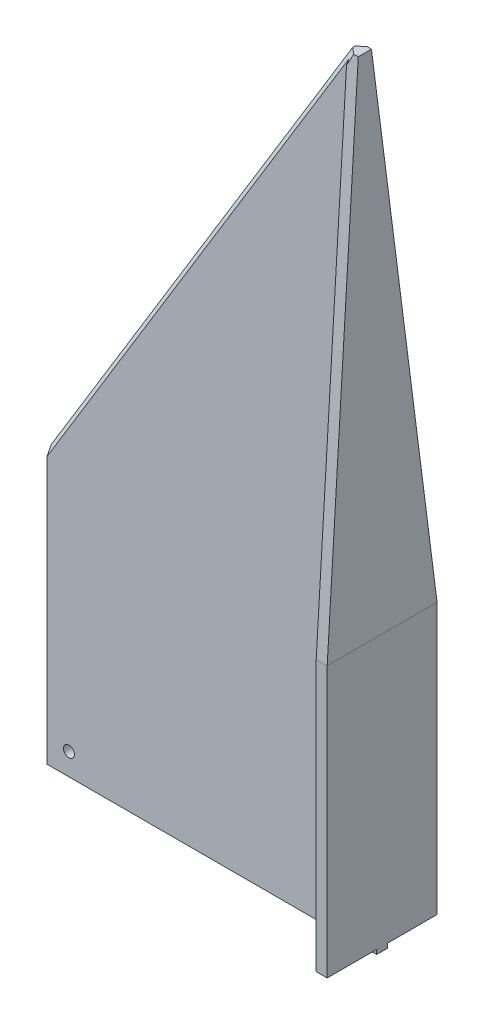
ISO-10303-21;
HEADER;
FILE_DESCRIPTION(('STEP AP214'),'2;1');
FILE_NAME('part.step','',(''),(''),'','','');
FILE_SCHEMA(('AUTOMOTIVE_DESIGN { 1 0 10303 214 1 1 1 1 }'));
ENDSEC;
DATA;
#1=APPLICATION_CONTEXT('core data for automotive mechanical design processes');
#2=APPLICATION_PROTOCOL_DEFINITION('international standard','automotive_design',2000,#1);
#3=PRODUCT_CONTEXT('',#1,'mechanical');
#4=PRODUCT('Part','Part','',(#3));
#5=PRODUCT_RELATED_PRODUCT_CATEGORY('part','',(#4));
#6=PRODUCT_DEFINITION_FORMATION('','',#4);
#7=PRODUCT_DEFINITION_CONTEXT('part definition',#1,'design');
#8=PRODUCT_DEFINITION('design','',#6,#7);
#9=PRODUCT_DEFINITION_SHAPE('','',#8);
#10=(LENGTH_UNIT() NAMED_UNIT(*) SI_UNIT(.MILLI.,.METRE.));
#11=(NAMED_UNIT(*) PLANE_ANGLE_UNIT() SI_UNIT($,.RADIAN.));
#12=(NAMED_UNIT(*) SI_UNIT($,.STERADIAN.) SOLID_ANGLE_UNIT());
#13=UNCERTAINTY_MEASURE_WITH_UNIT(LENGTH_MEASURE(1.E-05),#10,'distance_accuracy_value','');
#14=(GEOMETRIC_REPRESENTATION_CONTEXT(3) GLOBAL_UNCERTAINTY_ASSIGNED_CONTEXT((#13)) GLOBAL_UNIT_ASSIGNED_CONTEXT((#10,
#11,#12)) REPRESENTATION_CONTEXT('',''));
#15=CARTESIAN_POINT('',(0.,0.,0.));
#16=DIRECTION('',(0.,0.,1.));
#17=DIRECTION('',(1.,0.,0.));
#18=AXIS2_PLACEMENT_3D('',#15,#16,#17);
#19=CARTESIAN_POINT('',(0.,-125.,2.5));
#20=DIRECTION('',(0.,0.,1.));
#21=DIRECTION('',(1.,0.,0.));
#22=AXIS2_PLACEMENT_3D('',#19,#20,#21);
#23=PLANE('',#22);
#24=CARTESIAN_POINT('',(-140.,-115.,2.5));
#25=DIRECTION('',(0.,0.,1.));
#26=DIRECTION('',(1.,0.,0.));
#27=AXIS2_PLACEMENT_3D('',#24,#25,#26);
#28=CIRCLE('',#27,2.5);
#29=CARTESIAN_POINT('',(-137.5,-115.,2.5));
#30=VERTEX_POINT('',#29);
#31=EDGE_CURVE('E202',#30,#30,#28,.T.);
#32=ORIENTED_EDGE('',*,*,#31,.F.);
#33=EDGE_LOOP('',(#32));
#34=FACE_BOUND('',#33,.T.);
#35=DIRECTION('',(-0.0348994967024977,0.999390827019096,0.));
#36=VECTOR('',#35,1.);
#37=CARTESIAN_POINT('',(-0.634130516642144,-125.022144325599,2.5));
#38=LINE('',#37,#36);
#39=CARTESIAN_POINT('',(-5.,0.,2.5));
#40=VERTEX_POINT('',#39);
#41=CARTESIAN_POINT('',(-12.7302533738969,221.365493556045,2.49999999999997));
#42=VERTEX_POINT('',#41);
#43=EDGE_CURVE('E230',#40,#42,#38,.T.);
#44=ORIENTED_EDGE('',*,*,#43,.T.);
#45=DIRECTION('',(-0.520462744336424,-0.853884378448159,0.));
#46=VECTOR('',#45,1.);
#47=CARTESIAN_POINT('',(-148.292231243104,-1.04092548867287,2.5));
#48=LINE('',#47,#46);
#49=CARTESIAN_POINT('',(-150.,-3.84273422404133,2.5));
#50=VERTEX_POINT('',#49);
#51=EDGE_CURVE('E221',#42,#50,#48,.T.);
#52=ORIENTED_EDGE('',*,*,#51,.T.);
#53=DIRECTION('',(0.,-1.,0.));
#54=VECTOR('',#53,1.);
#55=CARTESIAN_POINT('',(-150.,0.,2.5));
#56=LINE('',#55,#54);
#57=CARTESIAN_POINT('',(-150.,-125.,2.5));
#58=VERTEX_POINT('',#57);
#59=EDGE_CURVE('E227',#50,#58,#56,.T.);
#60=ORIENTED_EDGE('',*,*,#59,.T.);
#61=DIRECTION('',(1.,0.,0.));
#62=VECTOR('',#61,1.);
#63=CARTESIAN_POINT('',(-150.,-125.,2.5));
#64=LINE('',#63,#62);
#65=CARTESIAN_POINT('',(0.,-125.,2.5));
#66=VERTEX_POINT('',#65);
#67=EDGE_CURVE('E244',#58,#66,#64,.T.);
#68=ORIENTED_EDGE('',*,*,#67,.T.);
#69=DIRECTION('',(0.,1.,0.));
#70=VECTOR('',#69,1.);
#71=CARTESIAN_POINT('',(0.,-125.,2.5));
#72=LINE('',#71,#70);
#73=CARTESIAN_POINT('',(0.,-123.,2.5));
#74=VERTEX_POINT('',#73);
#75=EDGE_CURVE('E239',#66,#74,#72,.T.);
#76=ORIENTED_EDGE('',*,*,#75,.T.);
#77=DIRECTION('',(-1.,0.,0.));
#78=VECTOR('',#77,1.);
#79=CARTESIAN_POINT('',(0.,-123.,2.5));
#80=LINE('',#79,#78);
#81=CARTESIAN_POINT('',(-5.,-123.,2.5));
#82=VERTEX_POINT('',#81);
#83=EDGE_CURVE('E284',#74,#82,#80,.T.);
#84=ORIENTED_EDGE('',*,*,#83,.T.);
#85=DIRECTION('',(0.,1.,0.));
#86=VECTOR('',#85,1.);
#87=CARTESIAN_POINT('',(-5.,-125.,2.5));
#88=LINE('',#87,#86);
#89=EDGE_CURVE('E290',#82,#40,#88,.T.);
#90=ORIENTED_EDGE('',*,*,#89,.T.);
#91=EDGE_LOOP('',(#44,#52,#60,#68,#76,#84,#90));
#92=FACE_BOUND('',#91,.T.);
#93=ADVANCED_FACE('F34',(#34,#92),#23,.T.);
#94=CARTESIAN_POINT('',(0.,-125.,-2.5));
#95=DIRECTION('',(0.,0.,1.));
#96=DIRECTION('',(1.,0.,0.));
#97=AXIS2_PLACEMENT_3D('',#94,#95,#96);
#98=PLANE('',#97);
#99=CARTESIAN_POINT('',(-140.,-115.,-2.5));
#100=DIRECTION('',(0.,0.,1.));
#101=DIRECTION('',(1.,0.,0.));
#102=AXIS2_PLACEMENT_3D('',#99,#100,#101);
#103=CIRCLE('',#102,2.5);
#104=CARTESIAN_POINT('',(-137.5,-115.,-2.5));
#105=VERTEX_POINT('',#104);
#106=EDGE_CURVE('E199',#105,#105,#103,.T.);
#107=ORIENTED_EDGE('',*,*,#106,.T.);
#108=EDGE_LOOP('',(#107));
#109=FACE_BOUND('',#108,.T.);
#110=DIRECTION('',(0.,-1.,0.));
#111=VECTOR('',#110,1.);
#112=CARTESIAN_POINT('',(-150.,0.,-2.5));
#113=LINE('',#112,#111);
#114=CARTESIAN_POINT('',(-150.,-3.84273422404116,-2.5));
#115=VERTEX_POINT('',#114);
#116=CARTESIAN_POINT('',(-150.,-125.,-2.5));
#117=VERTEX_POINT('',#116);
#118=EDGE_CURVE('E254',#115,#117,#113,.T.);
#119=ORIENTED_EDGE('',*,*,#118,.F.);
#120=DIRECTION('',(0.520462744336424,0.853884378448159,0.));
#121=VECTOR('',#120,1.);
#122=CARTESIAN_POINT('',(-163.211886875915,-25.5184909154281,-2.5));
#123=LINE('',#122,#121);
#124=CARTESIAN_POINT('',(-12.7302533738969,221.365493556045,-2.49999999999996));
#125=VERTEX_POINT('',#124);
#126=EDGE_CURVE('E211',#115,#125,#123,.T.);
#127=ORIENTED_EDGE('',*,*,#126,.T.);
#128=DIRECTION('',(-0.0348994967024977,0.999390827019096,0.));
#129=VECTOR('',#128,1.);
#130=CARTESIAN_POINT('',(-0.634130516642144,-125.022144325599,-2.5));
#131=LINE('',#130,#129);
#132=CARTESIAN_POINT('',(-5.,0.,-2.5));
#133=VERTEX_POINT('',#132);
#134=EDGE_CURVE('E181',#133,#125,#131,.T.);
#135=ORIENTED_EDGE('',*,*,#134,.F.);
#136=DIRECTION('',(0.,1.,0.));
#137=VECTOR('',#136,1.);
#138=CARTESIAN_POINT('',(-5.,-125.,-2.5));
#139=LINE('',#138,#137);
#140=CARTESIAN_POINT('',(-5.,-123.,-2.5));
#141=VERTEX_POINT('',#140);
#142=EDGE_CURVE('E185',#141,#133,#139,.T.);
#143=ORIENTED_EDGE('',*,*,#142,.F.);
#144=DIRECTION('',(-1.,0.,0.));
#145=VECTOR('',#144,1.);
#146=CARTESIAN_POINT('',(0.,-123.,-2.5));
#147=LINE('',#146,#145);
#148=CARTESIAN_POINT('',(0.,-123.,-2.5));
#149=VERTEX_POINT('',#148);
#150=EDGE_CURVE('E263',#149,#141,#147,.T.);
#151=ORIENTED_EDGE('',*,*,#150,.F.);
#152=DIRECTION('',(0.,1.,0.));
#153=VECTOR('',#152,1.);
#154=CARTESIAN_POINT('',(0.,-125.,-2.5));
#155=LINE('',#154,#153);
#156=CARTESIAN_POINT('',(0.,-125.,-2.5));
#157=VERTEX_POINT('',#156);
#158=EDGE_CURVE('E251',#157,#149,#155,.T.);
#159=ORIENTED_EDGE('',*,*,#158,.F.);
#160=DIRECTION('',(1.,0.,0.));
#161=VECTOR('',#160,1.);
#162=CARTESIAN_POINT('',(-150.,-125.,-2.5));
#163=LINE('',#162,#161);
#164=EDGE_CURVE('E248',#117,#157,#163,.T.);
#165=ORIENTED_EDGE('',*,*,#164,.F.);
#166=EDGE_LOOP('',(#119,#127,#135,#143,#151,#159,#165));
#167=FACE_BOUND('',#166,.T.);
#168=ADVANCED_FACE('F315',(#109,#167),#98,.F.);
#169=CARTESIAN_POINT('',(-150.,-125.,2.5));
#170=DIRECTION('',(0.,1.,0.));
#171=DIRECTION('',(0.,0.,1.));
#172=AXIS2_PLACEMENT_3D('',#169,#170,#171);
#173=PLANE('',#172);
#174=ORIENTED_EDGE('',*,*,#164,.T.);
#175=DIRECTION('',(0.,0.,-1.));
#176=VECTOR('',#175,1.);
#177=CARTESIAN_POINT('',(0.,-125.,2.5));
#178=LINE('',#177,#176);
#179=EDGE_CURVE('E166',#66,#157,#178,.T.);
#180=ORIENTED_EDGE('',*,*,#179,.F.);
#181=ORIENTED_EDGE('',*,*,#67,.F.);
#182=DIRECTION('',(0.,0.,-1.));
#183=VECTOR('',#182,1.);
#184=CARTESIAN_POINT('',(-150.,-125.,2.5));
#185=LINE('',#184,#183);
#186=EDGE_CURVE('E237',#58,#117,#185,.T.);
#187=ORIENTED_EDGE('',*,*,#186,.T.);
#188=EDGE_LOOP('',(#174,#180,#181,#187));
#189=FACE_BOUND('',#188,.T.);
#190=ADVANCED_FACE('F294',(#189),#173,.F.);
#191=CARTESIAN_POINT('',(0.,-125.,2.5));
#192=DIRECTION('',(-1.,0.,0.));
#193=DIRECTION('',(0.,0.,1.));
#194=AXIS2_PLACEMENT_3D('',#191,#192,#193);
#195=PLANE('',#194);
#196=DIRECTION('',(0.,0.,-1.));
#197=VECTOR('',#196,1.);
#198=CARTESIAN_POINT('',(0.,0.,2.5));
#199=LINE('',#198,#197);
#200=CARTESIAN_POINT('',(0.,0.,25.));
#201=VERTEX_POINT('',#200);
#202=CARTESIAN_POINT('',(0.,0.,-25.));
#203=VERTEX_POINT('',#202);
#204=EDGE_CURVE('E149',#201,#203,#199,.T.);
#205=ORIENTED_EDGE('',*,*,#204,.F.);
#206=DIRECTION('',(0.,1.,0.));
#207=VECTOR('',#206,1.);
#208=CARTESIAN_POINT('',(0.,-123.,25.));
#209=LINE('',#208,#207);
#210=CARTESIAN_POINT('',(0.,-123.,25.));
#211=VERTEX_POINT('',#210);
#212=EDGE_CURVE('E162',#211,#201,#209,.T.);
#213=ORIENTED_EDGE('',*,*,#212,.F.);
#214=DIRECTION('',(0.,0.,-1.));
#215=VECTOR('',#214,1.);
#216=CARTESIAN_POINT('',(0.,-123.,25.));
#217=LINE('',#216,#215);
#218=EDGE_CURVE('E297',#211,#74,#217,.T.);
#219=ORIENTED_EDGE('',*,*,#218,.T.);
#220=ORIENTED_EDGE('',*,*,#75,.F.);
#221=ORIENTED_EDGE('',*,*,#179,.T.);
#222=ORIENTED_EDGE('',*,*,#158,.T.);
#223=CARTESIAN_POINT('',(0.,-123.,-25.));
#224=VERTEX_POINT('',#223);
#225=EDGE_CURVE('E299',#149,#224,#217,.T.);
#226=ORIENTED_EDGE('',*,*,#225,.T.);
#227=DIRECTION('',(0.,1.,0.));
#228=VECTOR('',#227,1.);
#229=CARTESIAN_POINT('',(0.,-123.,-25.));
#230=LINE('',#229,#228);
#231=EDGE_CURVE('E164',#224,#203,#230,.T.);
#232=ORIENTED_EDGE('',*,*,#231,.T.);
#233=EDGE_LOOP('',(#205,#213,#219,#220,#221,#222,#226,#232));
#234=FACE_BOUND('',#233,.T.);
#235=ADVANCED_FACE('F160',(#234),#195,.F.);
#236=CARTESIAN_POINT('',(0.,0.,2.5));
#237=DIRECTION('',(-0.999390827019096,-0.0348994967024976,0.));
#238=DIRECTION('',(0.0348994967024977,-0.999390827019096,0.));
#239=AXIS2_PLACEMENT_3D('',#236,#237,#238);
#240=PLANE('',#239);
#241=ORIENTED_EDGE('',*,*,#204,.T.);
#242=DIRECTION('',(0.0347340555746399,-0.99465321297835,-0.0972549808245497));
#243=VECTOR('',#242,1.);
#244=CARTESIAN_POINT('',(-7.85717313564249,225.,-3.));
#245=LINE('',#244,#243);
#246=CARTESIAN_POINT('',(-7.85717313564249,225.,-3.));
#247=VERTEX_POINT('',#246);
#248=EDGE_CURVE('E196',#203,#247,#245,.F.);
#249=ORIENTED_EDGE('',*,*,#248,.T.);
#250=DIRECTION('',(0.,0.,-1.));
#251=VECTOR('',#250,1.);
#252=CARTESIAN_POINT('',(-7.85717313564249,225.,2.5));
#253=LINE('',#252,#251);
#254=CARTESIAN_POINT('',(-7.85717313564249,225.,2.99999999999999));
#255=VERTEX_POINT('',#254);
#256=EDGE_CURVE('E152',#255,#247,#253,.T.);
#257=ORIENTED_EDGE('',*,*,#256,.F.);
#258=DIRECTION('',(0.0347340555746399,-0.99465321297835,0.0972549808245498));
#259=VECTOR('',#258,1.);
#260=CARTESIAN_POINT('',(0.,0.,25.));
#261=LINE('',#260,#259);
#262=EDGE_CURVE('E146',#255,#201,#261,.T.);
#263=ORIENTED_EDGE('',*,*,#262,.T.);
#264=EDGE_LOOP('',(#241,#249,#257,#263));
#265=FACE_BOUND('',#264,.T.);
#266=ADVANCED_FACE('F148',(#265),#240,.F.);
#267=CARTESIAN_POINT('',(-7.85717313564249,225.,2.5));
#268=DIRECTION('',(0.,-1.,0.));
#269=DIRECTION('',(1.,0.,0.));
#270=AXIS2_PLACEMENT_3D('',#267,#268,#269);
#271=PLANE('',#270);
#272=DIRECTION('',(-1.,0.,0.));
#273=VECTOR('',#272,1.);
#274=CARTESIAN_POINT('',(-7.85717313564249,225.,-3.));
#275=LINE('',#274,#273);
#276=CARTESIAN_POINT('',(-9.92937627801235,225.,-3.));
#277=VERTEX_POINT('',#276);
#278=EDGE_CURVE('E154',#247,#277,#275,.T.);
#279=ORIENTED_EDGE('',*,*,#278,.T.);
#280=DIRECTION('',(0.760479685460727,0.,-0.649361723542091));
#281=VECTOR('',#280,1.);
#282=CARTESIAN_POINT('',(-12.8571731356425,225.,-0.499999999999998));
#283=LINE('',#282,#281);
#284=CARTESIAN_POINT('',(-12.8571731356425,225.,-0.499999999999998));
#285=VERTEX_POINT('',#284);
#286=EDGE_CURVE('E219',#277,#285,#283,.F.);
#287=ORIENTED_EDGE('',*,*,#286,.T.);
#288=DIRECTION('',(0.,0.,-1.));
#289=VECTOR('',#288,1.);
#290=CARTESIAN_POINT('',(-12.8571731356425,225.,2.5));
#291=LINE('',#290,#289);
#292=CARTESIAN_POINT('',(-12.8571731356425,225.,0.499999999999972));
#293=VERTEX_POINT('',#292);
#294=EDGE_CURVE('E257',#293,#285,#291,.T.);
#295=ORIENTED_EDGE('',*,*,#294,.F.);
#296=DIRECTION('',(0.760479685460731,0.,0.649361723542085));
#297=VECTOR('',#296,1.);
#298=CARTESIAN_POINT('',(-98.8240645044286,224.999999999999,-72.9057856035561));
#299=LINE('',#298,#297);
#300=CARTESIAN_POINT('',(-9.92937627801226,225.,2.99999999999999));
#301=VERTEX_POINT('',#300);
#302=EDGE_CURVE('E217',#293,#301,#299,.T.);
#303=ORIENTED_EDGE('',*,*,#302,.T.);
#304=DIRECTION('',(1.,0.,0.));
#305=VECTOR('',#304,1.);
#306=CARTESIAN_POINT('',(-7.85717313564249,225.,2.99999999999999));
#307=LINE('',#306,#305);
#308=EDGE_CURVE('E155',#301,#255,#307,.T.);
#309=ORIENTED_EDGE('',*,*,#308,.T.);
#310=ORIENTED_EDGE('',*,*,#256,.T.);
#311=EDGE_LOOP('',(#279,#287,#295,#303,#309,#310));
#312=FACE_BOUND('',#311,.T.);
#313=ADVANCED_FACE('F332',(#312),#271,.F.);
#314=CARTESIAN_POINT('',(-12.8571731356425,225.,2.5));
#315=DIRECTION('',(0.853884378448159,-0.520462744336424,0.));
#316=DIRECTION('',(0.520462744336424,0.853884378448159,0.));
#317=AXIS2_PLACEMENT_3D('',#314,#315,#316);
#318=PLANE('',#317);
#319=ORIENTED_EDGE('',*,*,#294,.T.);
#320=DIRECTION('',(-0.520462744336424,-0.853884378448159,0.));
#321=VECTOR('',#320,1.);
#322=CARTESIAN_POINT('',(-12.8571731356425,225.,-0.49999999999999));
#323=LINE('',#322,#321);
#324=CARTESIAN_POINT('',(-150.,0.,-0.499999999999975));
#325=VERTEX_POINT('',#324);
#326=EDGE_CURVE('E204',#285,#325,#323,.T.);
#327=ORIENTED_EDGE('',*,*,#326,.T.);
#328=DIRECTION('',(0.,0.,-1.));
#329=VECTOR('',#328,1.);
#330=CARTESIAN_POINT('',(-150.,0.,2.5));
#331=LINE('',#330,#329);
#332=CARTESIAN_POINT('',(-150.,0.,0.499999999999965));
#333=VERTEX_POINT('',#332);
#334=EDGE_CURVE('E241',#333,#325,#331,.T.);
#335=ORIENTED_EDGE('',*,*,#334,.F.);
#336=DIRECTION('',(0.520462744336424,0.853884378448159,0.));
#337=VECTOR('',#336,1.);
#338=CARTESIAN_POINT('',(-12.8571731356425,225.,0.499999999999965));
#339=LINE('',#338,#337);
#340=EDGE_CURVE('E198',#333,#293,#339,.T.);
#341=ORIENTED_EDGE('',*,*,#340,.T.);
#342=EDGE_LOOP('',(#319,#327,#335,#341));
#343=FACE_BOUND('',#342,.T.);
#344=ADVANCED_FACE('F329',(#343),#318,.F.);
#345=CARTESIAN_POINT('',(-150.,0.,2.5));
#346=DIRECTION('',(1.,0.,0.));
#347=DIRECTION('',(0.,1.,0.));
#348=AXIS2_PLACEMENT_3D('',#345,#346,#347);
#349=PLANE('',#348);
#350=ORIENTED_EDGE('',*,*,#334,.T.);
#351=DIRECTION('',(0.,0.887048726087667,0.461675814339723));
#352=VECTOR('',#351,1.);
#353=CARTESIAN_POINT('',(-150.,177.042474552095,91.6440121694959));
#354=LINE('',#353,#352);
#355=EDGE_CURVE('E209',#325,#115,#354,.F.);
#356=ORIENTED_EDGE('',*,*,#355,.T.);
#357=ORIENTED_EDGE('',*,*,#118,.T.);
#358=ORIENTED_EDGE('',*,*,#186,.F.);
#359=ORIENTED_EDGE('',*,*,#59,.F.);
#360=DIRECTION('',(0.,0.88704872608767,-0.461675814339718));
#361=VECTOR('',#360,1.);
#362=CARTESIAN_POINT('',(-150.,-20.8984213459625,11.3768497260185));
#363=LINE('',#362,#361);
#364=EDGE_CURVE('E207',#50,#333,#363,.T.);
#365=ORIENTED_EDGE('',*,*,#364,.T.);
#366=EDGE_LOOP('',(#350,#356,#357,#358,#359,#365));
#367=FACE_BOUND('',#366,.T.);
#368=ADVANCED_FACE('F234',(#367),#349,.F.);
#369=CARTESIAN_POINT('',(0.,225.,-25.));
#370=DIRECTION('',(0.,0.,1.));
#371=DIRECTION('',(1.,0.,0.));
#372=AXIS2_PLACEMENT_3D('',#369,#370,#371);
#373=PLANE('',#372);
#374=DIRECTION('',(0.,-1.,0.));
#375=VECTOR('',#374,1.);
#376=CARTESIAN_POINT('',(-5.,-123.,-25.));
#377=LINE('',#376,#375);
#378=CARTESIAN_POINT('',(-5.,0.,-25.));
#379=VERTEX_POINT('',#378);
#380=CARTESIAN_POINT('',(-5.,-123.,-25.));
#381=VERTEX_POINT('',#380);
#382=EDGE_CURVE('E303',#379,#381,#377,.T.);
#383=ORIENTED_EDGE('',*,*,#382,.F.);
#384=DIRECTION('',(1.,0.,0.));
#385=VECTOR('',#384,1.);
#386=CARTESIAN_POINT('',(1.2490009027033E-12,0.,-25.));
#387=LINE('',#386,#385);
#388=EDGE_CURVE('E194',#379,#203,#387,.T.);
#389=ORIENTED_EDGE('',*,*,#388,.T.);
#390=ORIENTED_EDGE('',*,*,#231,.F.);
#391=DIRECTION('',(1.,0.,0.));
#392=VECTOR('',#391,1.);
#393=CARTESIAN_POINT('',(0.,-123.,-25.));
#394=LINE('',#393,#392);
#395=EDGE_CURVE('E177',#381,#224,#394,.T.);
#396=ORIENTED_EDGE('',*,*,#395,.F.);
#397=EDGE_LOOP('',(#383,#389,#390,#396));
#398=FACE_BOUND('',#397,.T.);
#399=ADVANCED_FACE('F328',(#398),#373,.F.);
#400=CARTESIAN_POINT('',(0.,-123.,25.));
#401=DIRECTION('',(0.,1.,0.));
#402=DIRECTION('',(0.,0.,1.));
#403=AXIS2_PLACEMENT_3D('',#400,#401,#402);
#404=PLANE('',#403);
#405=ORIENTED_EDGE('',*,*,#225,.F.);
#406=ORIENTED_EDGE('',*,*,#150,.T.);
#407=DIRECTION('',(0.,0.,-1.));
#408=VECTOR('',#407,1.);
#409=CARTESIAN_POINT('',(-5.,-123.,25.));
#410=LINE('',#409,#408);
#411=EDGE_CURVE('E274',#141,#381,#410,.T.);
#412=ORIENTED_EDGE('',*,*,#411,.T.);
#413=ORIENTED_EDGE('',*,*,#395,.T.);
#414=EDGE_LOOP('',(#405,#406,#412,#413));
#415=FACE_BOUND('',#414,.T.);
#416=ADVANCED_FACE('F364',(#415),#404,.F.);
#417=CARTESIAN_POINT('',(-5.,-123.,25.));
#418=DIRECTION('',(1.,0.,0.));
#419=DIRECTION('',(0.,1.,0.));
#420=AXIS2_PLACEMENT_3D('',#417,#418,#419);
#421=PLANE('',#420);
#422=ORIENTED_EDGE('',*,*,#411,.F.);
#423=ORIENTED_EDGE('',*,*,#142,.T.);
#424=DIRECTION('',(0.,0.,-1.));
#425=VECTOR('',#424,1.);
#426=CARTESIAN_POINT('',(-5.,0.,25.));
#427=LINE('',#426,#425);
#428=EDGE_CURVE('E272',#133,#379,#427,.T.);
#429=ORIENTED_EDGE('',*,*,#428,.T.);
#430=ORIENTED_EDGE('',*,*,#382,.T.);
#431=EDGE_LOOP('',(#422,#423,#429,#430));
#432=FACE_BOUND('',#431,.T.);
#433=ADVANCED_FACE('F270',(#432),#421,.F.);
#434=CARTESIAN_POINT('',(-12.8571731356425,225.,25.));
#435=DIRECTION('',(0.999390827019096,0.0348994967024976,0.));
#436=DIRECTION('',(-0.0348994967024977,0.999390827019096,0.));
#437=AXIS2_PLACEMENT_3D('',#434,#435,#436);
#438=PLANE('',#437);
#439=ORIENTED_EDGE('',*,*,#134,.T.);
#440=DIRECTION('',(-0.0305801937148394,0.875702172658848,0.48188230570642));
#441=VECTOR('',#440,1.);
#442=CARTESIAN_POINT('',(-12.8571731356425,225.,-0.499999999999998));
#443=LINE('',#442,#441);
#444=CARTESIAN_POINT('',(-12.664242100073,219.475177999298,-3.54020481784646));
#445=VERTEX_POINT('',#444);
#446=EDGE_CURVE('E213',#125,#445,#443,.F.);
#447=ORIENTED_EDGE('',*,*,#446,.T.);
#448=DIRECTION('',(-0.0347340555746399,0.99465321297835,0.0972549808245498));
#449=VECTOR('',#448,1.);
#450=CARTESIAN_POINT('',(-12.8511408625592,224.827258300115,-3.01689029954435));
#451=LINE('',#450,#449);
#452=EDGE_CURVE('E192',#445,#379,#451,.F.);
#453=ORIENTED_EDGE('',*,*,#452,.T.);
#454=ORIENTED_EDGE('',*,*,#428,.F.);
#455=EDGE_LOOP('',(#439,#447,#453,#454));
#456=FACE_BOUND('',#455,.T.);
#457=ADVANCED_FACE('F277',(#456),#438,.F.);
#458=DIRECTION('',(-0.0347340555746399,0.99465321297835,-0.0972549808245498));
#459=VECTOR('',#458,1.);
#460=CARTESIAN_POINT('',(-4.99396772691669,-0.172741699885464,25.0168902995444));
#461=LINE('',#460,#459);
#462=CARTESIAN_POINT('',(-5.,0.,25.));
#463=VERTEX_POINT('',#462);
#464=CARTESIAN_POINT('',(-12.6642421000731,219.475177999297,3.54020481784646));
#465=VERTEX_POINT('',#464);
#466=EDGE_CURVE('E180',#463,#465,#461,.T.);
#467=ORIENTED_EDGE('',*,*,#466,.T.);
#468=DIRECTION('',(-0.0305801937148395,0.875702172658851,-0.481882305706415));
#469=VECTOR('',#468,1.);
#470=CARTESIAN_POINT('',(-6.25963471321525,36.0712186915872,104.463926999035));
#471=LINE('',#470,#469);
#472=EDGE_CURVE('E11',#465,#42,#471,.T.);
#473=ORIENTED_EDGE('',*,*,#472,.T.);
#474=ORIENTED_EDGE('',*,*,#43,.F.);
#475=EDGE_CURVE('E280',#463,#40,#427,.T.);
#476=ORIENTED_EDGE('',*,*,#475,.F.);
#477=EDGE_LOOP('',(#467,#473,#474,#476));
#478=FACE_BOUND('',#477,.T.);
#479=ADVANCED_FACE('F323',(#478),#438,.F.);
#480=ORIENTED_EDGE('',*,*,#89,.F.);
#481=CARTESIAN_POINT('',(-5.,-123.,25.));
#482=VERTEX_POINT('',#481);
#483=EDGE_CURVE('E281',#482,#82,#410,.T.);
#484=ORIENTED_EDGE('',*,*,#483,.F.);
#485=DIRECTION('',(0.,-1.,0.));
#486=VECTOR('',#485,1.);
#487=CARTESIAN_POINT('',(-5.,-123.,25.));
#488=LINE('',#487,#486);
#489=EDGE_CURVE('E176',#463,#482,#488,.T.);
#490=ORIENTED_EDGE('',*,*,#489,.F.);
#491=ORIENTED_EDGE('',*,*,#475,.T.);
#492=EDGE_LOOP('',(#480,#484,#490,#491));
#493=FACE_BOUND('',#492,.T.);
#494=ADVANCED_FACE('F377',(#493),#421,.F.);
#495=ORIENTED_EDGE('',*,*,#83,.F.);
#496=ORIENTED_EDGE('',*,*,#218,.F.);
#497=DIRECTION('',(1.,0.,0.));
#498=VECTOR('',#497,1.);
#499=CARTESIAN_POINT('',(0.,-123.,25.));
#500=LINE('',#499,#498);
#501=EDGE_CURVE('E174',#482,#211,#500,.T.);
#502=ORIENTED_EDGE('',*,*,#501,.F.);
#503=ORIENTED_EDGE('',*,*,#483,.T.);
#504=EDGE_LOOP('',(#495,#496,#502,#503));
#505=FACE_BOUND('',#504,.T.);
#506=ADVANCED_FACE('F372',(#505),#404,.F.);
#507=CARTESIAN_POINT('',(0.,225.,25.));
#508=DIRECTION('',(0.,0.,1.));
#509=DIRECTION('',(1.,0.,0.));
#510=AXIS2_PLACEMENT_3D('',#507,#508,#509);
#511=PLANE('',#510);
#512=ORIENTED_EDGE('',*,*,#212,.T.);
#513=DIRECTION('',(-1.,0.,0.));
#514=VECTOR('',#513,1.);
#515=CARTESIAN_POINT('',(-12.8571731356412,0.,25.));
#516=LINE('',#515,#514);
#517=EDGE_CURVE('E171',#201,#463,#516,.T.);
#518=ORIENTED_EDGE('',*,*,#517,.T.);
#519=ORIENTED_EDGE('',*,*,#489,.T.);
#520=ORIENTED_EDGE('',*,*,#501,.T.);
#521=EDGE_LOOP('',(#512,#518,#519,#520));
#522=FACE_BOUND('',#521,.T.);
#523=ADVANCED_FACE('F170',(#522),#511,.T.);
#524=CARTESIAN_POINT('',(1.2490009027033E-12,0.,25.));
#525=DIRECTION('',(0.,0.0973137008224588,0.99525375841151));
#526=DIRECTION('',(0.,-0.99525375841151,0.0973137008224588));
#527=AXIS2_PLACEMENT_3D('',#524,#525,#526);
#528=PLANE('',#527);
#529=ORIENTED_EDGE('',*,*,#308,.F.);
#530=DIRECTION('',(-0.441941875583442,-0.892786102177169,0.0872946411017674));
#531=VECTOR('',#530,1.);
#532=CARTESIAN_POINT('',(-97.6146872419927,47.8630701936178,20.3200553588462));
#533=LINE('',#532,#531);
#534=EDGE_CURVE('E42',#301,#465,#533,.T.);
#535=ORIENTED_EDGE('',*,*,#534,.T.);
#536=ORIENTED_EDGE('',*,*,#466,.F.);
#537=ORIENTED_EDGE('',*,*,#517,.F.);
#538=ORIENTED_EDGE('',*,*,#262,.F.);
#539=EDGE_LOOP('',(#529,#535,#536,#537,#538));
#540=FACE_BOUND('',#539,.T.);
#541=ADVANCED_FACE('F179',(#540),#528,.T.);
#542=CARTESIAN_POINT('',(-7.85717313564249,225.,-3.));
#543=DIRECTION('',(0.,-0.0973137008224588,0.99525375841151));
#544=DIRECTION('',(0.,-0.99525375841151,-0.0973137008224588));
#545=AXIS2_PLACEMENT_3D('',#542,#543,#544);
#546=PLANE('',#545);
#547=ORIENTED_EDGE('',*,*,#452,.F.);
#548=DIRECTION('',(0.441941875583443,0.892786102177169,0.0872946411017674));
#549=VECTOR('',#548,1.);
#550=CARTESIAN_POINT('',(-9.52464885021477,225.81760756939,-2.92005614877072));
#551=LINE('',#550,#549);
#552=EDGE_CURVE('E215',#445,#277,#551,.T.);
#553=ORIENTED_EDGE('',*,*,#552,.T.);
#554=ORIENTED_EDGE('',*,*,#278,.F.);
#555=ORIENTED_EDGE('',*,*,#248,.F.);
#556=ORIENTED_EDGE('',*,*,#388,.F.);
#557=EDGE_LOOP('',(#547,#553,#554,#555,#556));
#558=FACE_BOUND('',#557,.T.);
#559=ADVANCED_FACE('F345',(#558),#546,.F.);
#560=CARTESIAN_POINT('',(-140.,-115.,-25.));
#561=DIRECTION('',(0.,0.,1.));
#562=DIRECTION('',(1.,0.,0.));
#563=AXIS2_PLACEMENT_3D('',#560,#561,#562);
#564=CYLINDRICAL_SURFACE('',#563,2.5);
#565=ORIENTED_EDGE('',*,*,#31,.T.);
#566=EDGE_LOOP('',(#565));
#567=FACE_BOUND('',#566,.T.);
#568=ORIENTED_EDGE('',*,*,#106,.F.);
#569=EDGE_LOOP('',(#568));
#570=FACE_BOUND('',#569,.T.);
#571=ADVANCED_FACE('F311',(#567,#570),#564,.F.);
#572=CARTESIAN_POINT('',(-12.8571731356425,225.,-0.499999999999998));
#573=DIRECTION('',(0.603787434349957,-0.368022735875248,0.707106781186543));
#574=DIRECTION('',(0.760479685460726,0.,-0.649361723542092));
#575=AXIS2_PLACEMENT_3D('',#572,#573,#574);
#576=PLANE('',#575);
#577=ORIENTED_EDGE('',*,*,#446,.F.);
#578=ORIENTED_EDGE('',*,*,#126,.F.);
#579=ORIENTED_EDGE('',*,*,#355,.F.);
#580=ORIENTED_EDGE('',*,*,#326,.F.);
#581=ORIENTED_EDGE('',*,*,#286,.F.);
#582=ORIENTED_EDGE('',*,*,#552,.F.);
#583=EDGE_LOOP('',(#577,#578,#579,#580,#581,#582));
#584=FACE_BOUND('',#583,.T.);
#585=ADVANCED_FACE('F348',(#584),#576,.F.);
#586=CARTESIAN_POINT('',(-163.211886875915,-25.5184909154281,2.5));
#587=DIRECTION('',(-0.603787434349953,0.368022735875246,0.707106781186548));
#588=DIRECTION('',(0.76047968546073,0.,0.649361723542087));
#589=AXIS2_PLACEMENT_3D('',#586,#587,#588);
#590=PLANE('',#589);
#591=ORIENTED_EDGE('',*,*,#302,.F.);
#592=ORIENTED_EDGE('',*,*,#340,.F.);
#593=ORIENTED_EDGE('',*,*,#364,.F.);
#594=ORIENTED_EDGE('',*,*,#51,.F.);
#595=ORIENTED_EDGE('',*,*,#472,.F.);
#596=ORIENTED_EDGE('',*,*,#534,.F.);
#597=EDGE_LOOP('',(#591,#592,#593,#594,#595,#596));
#598=FACE_BOUND('',#597,.T.);
#599=ADVANCED_FACE('F36',(#598),#590,.T.);
#600=CLOSED_SHELL('',(#93,#168,#190,#235,#266,#313,#344,#368,#399,#416,#433,#457,#479,#494,#506,
#523,#541,#559,#571,#585,#599));
#601=MANIFOLD_SOLID_BREP('B2',#600);
#602=ADVANCED_BREP_SHAPE_REPRESENTATION('',(#18,#601),#14);
#603=SHAPE_DEFINITION_REPRESENTATION(#9,#602);
ENDSEC;
END-ISO-10303-21;
